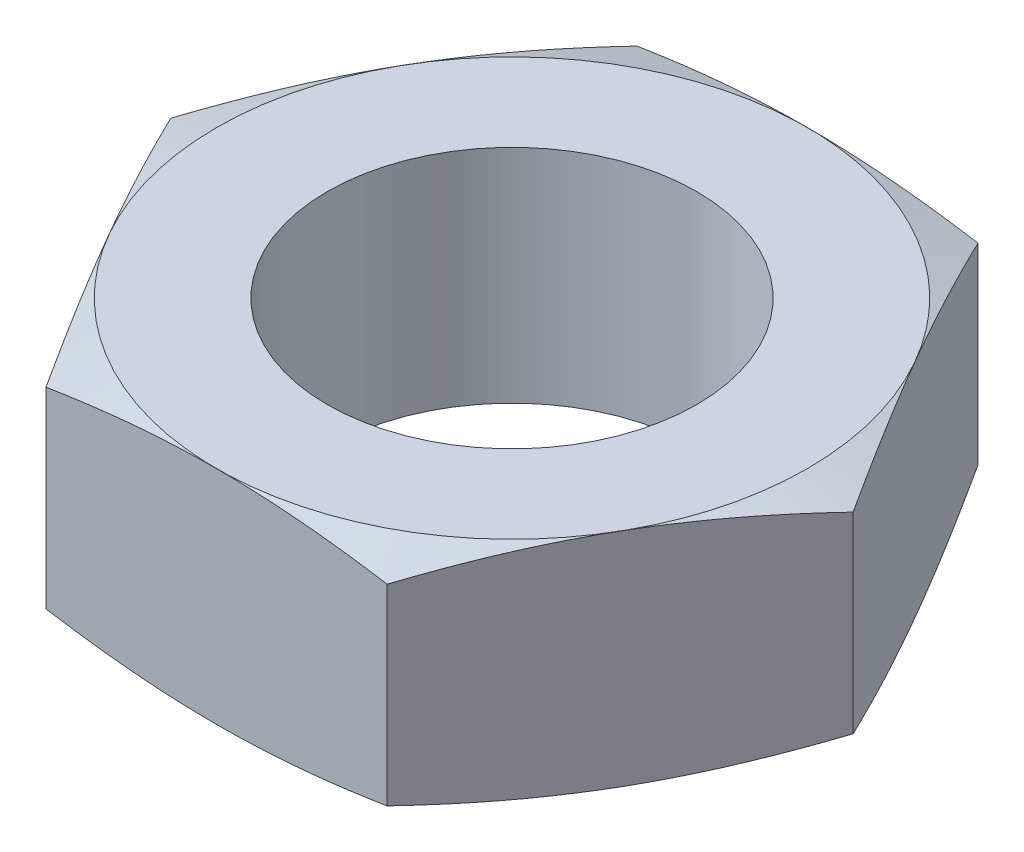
from build123d import *

# Parameters (mm, degrees)
SKETCH5_R      = 3.96875
EXTRUDE2_DEPTH = 4.7625


with BuildPart() as part:
    # Sketch5 → Extrude2 (new body)
    with BuildSketch(Plane(origin=(0, 0, 0), x_dir=(1, 0, 0), z_dir=(0, 1, 0))):
        Polygon((-7.332348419, 0), (-3.666174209, -6.35), (3.666174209, -6.35), (7.332348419, 0), (3.666174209, 6.35), (-3.666174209, 6.35), align=None)
        with Locations(Location((0, 0, 0), (0, 0, 90))):
            Circle(SKETCH5_R, mode=Mode.SUBTRACT)
    extrude(amount=EXTRUDE2_DEPTH)

    # Sketch6 → Cut-Revolve1 (revolve, cut)
    with BuildSketch(Plane.XY):
        Polygon((7.332348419, 0), (7.332348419, 0.3175), (6.349368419, 0), align=None)
        Polygon((7.332348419, 4.7625), (7.332348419, 4.445), (6.349368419, 4.7625), align=None)
    revolve(axis=Axis((0, 0, 0), (0, 1, 0)), mode=Mode.SUBTRACT)


solid = part.part
